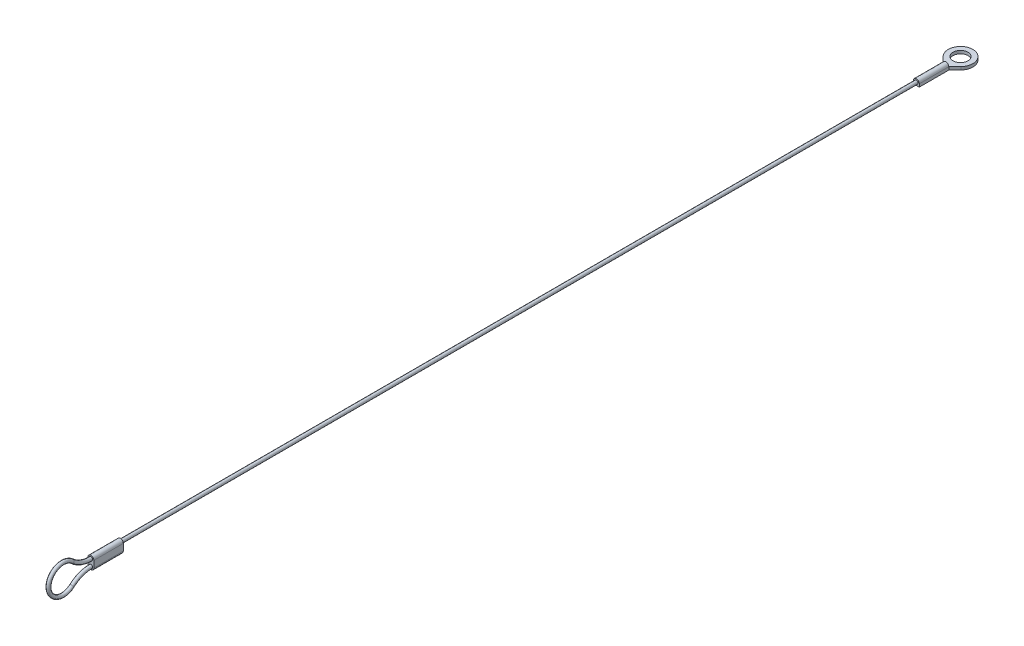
ISO-10303-21;
HEADER;
FILE_DESCRIPTION(('STEP AP214'),'2;1');
FILE_NAME('part.step','',(''),(''),'','','');
FILE_SCHEMA(('AUTOMOTIVE_DESIGN { 1 0 10303 214 1 1 1 1 }'));
ENDSEC;
DATA;
#1=APPLICATION_CONTEXT('core data for automotive mechanical design processes');
#2=APPLICATION_PROTOCOL_DEFINITION('international standard','automotive_design',2000,#1);
#3=PRODUCT_CONTEXT('',#1,'mechanical');
#4=PRODUCT('Part','Part','',(#3));
#5=PRODUCT_RELATED_PRODUCT_CATEGORY('part','',(#4));
#6=PRODUCT_DEFINITION_FORMATION('','',#4);
#7=PRODUCT_DEFINITION_CONTEXT('part definition',#1,'design');
#8=PRODUCT_DEFINITION('design','',#6,#7);
#9=PRODUCT_DEFINITION_SHAPE('','',#8);
#10=(LENGTH_UNIT() NAMED_UNIT(*) SI_UNIT(.MILLI.,.METRE.));
#11=(NAMED_UNIT(*) PLANE_ANGLE_UNIT() SI_UNIT($,.RADIAN.));
#12=(NAMED_UNIT(*) SI_UNIT($,.STERADIAN.) SOLID_ANGLE_UNIT());
#13=UNCERTAINTY_MEASURE_WITH_UNIT(LENGTH_MEASURE(1.E-05),#10,'distance_accuracy_value','');
#14=(GEOMETRIC_REPRESENTATION_CONTEXT(3) GLOBAL_UNCERTAINTY_ASSIGNED_CONTEXT((#13)) GLOBAL_UNIT_ASSIGNED_CONTEXT((#10,
#11,#12)) REPRESENTATION_CONTEXT('',''));
#15=CARTESIAN_POINT('',(0.,0.,0.));
#16=DIRECTION('',(0.,0.,1.));
#17=DIRECTION('',(1.,0.,0.));
#18=AXIS2_PLACEMENT_3D('',#15,#16,#17);
#19=CARTESIAN_POINT('',(0.,0.,-10.));
#20=DIRECTION('',(0.,0.,-1.));
#21=DIRECTION('',(-1.,0.,0.));
#22=AXIS2_PLACEMENT_3D('',#19,#20,#21);
#23=PLANE('',#22);
#24=CARTESIAN_POINT('',(0.,0.,-10.));
#25=DIRECTION('',(0.,0.,-1.));
#26=DIRECTION('',(-1.,0.,0.));
#27=AXIS2_PLACEMENT_3D('',#24,#25,#26);
#28=CIRCLE('',#27,0.995);
#29=CARTESIAN_POINT('',(-0.995,0.00749999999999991,-10.));
#30=VERTEX_POINT('',#29);
#31=CARTESIAN_POINT('',(0.995,0.00749999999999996,-10.));
#32=VERTEX_POINT('',#31);
#33=EDGE_CURVE('E178',#30,#32,#28,.T.);
#34=ORIENTED_EDGE('',*,*,#33,.T.);
#35=DIRECTION('',(-1.,0.,0.));
#36=VECTOR('',#35,1.);
#37=CARTESIAN_POINT('',(-0.995,0.015,-10.));
#38=LINE('',#37,#36);
#39=EDGE_CURVE('E135',#32,#30,#38,.T.);
#40=ORIENTED_EDGE('',*,*,#39,.T.);
#41=EDGE_LOOP('',(#34,#40));
#42=FACE_BOUND('',#41,.T.);
#43=ADVANCED_FACE('F39',(#42),#23,.T.);
#44=CARTESIAN_POINT('',(0.,0.,280.2));
#45=DIRECTION('',(0.,0.,-1.));
#46=DIRECTION('',(-1.,0.,0.));
#47=AXIS2_PLACEMENT_3D('',#44,#45,#46);
#48=CYLINDRICAL_SURFACE('',#47,0.595);
#49=CARTESIAN_POINT('',(0.,0.,270.2));
#50=DIRECTION('',(0.,0.,-1.));
#51=DIRECTION('',(0.,1.,0.));
#52=AXIS2_PLACEMENT_3D('',#49,#50,#51);
#53=CIRCLE('',#52,0.595);
#54=CARTESIAN_POINT('',(0.,0.595,270.2));
#55=VERTEX_POINT('',#54);
#56=EDGE_CURVE('E225',#55,#55,#53,.T.);
#57=ORIENTED_EDGE('',*,*,#56,.T.);
#58=EDGE_LOOP('',(#57));
#59=FACE_BOUND('',#58,.T.);
#60=CARTESIAN_POINT('',(0.,0.,0.));
#61=DIRECTION('',(0.,0.,1.));
#62=DIRECTION('',(1.,0.,0.));
#63=AXIS2_PLACEMENT_3D('',#60,#61,#62);
#64=CIRCLE('',#63,0.595);
#65=CARTESIAN_POINT('',(0.595,0.,0.));
#66=VERTEX_POINT('',#65);
#67=EDGE_CURVE('E201',#66,#66,#64,.T.);
#68=ORIENTED_EDGE('',*,*,#67,.T.);
#69=EDGE_LOOP('',(#68));
#70=FACE_BOUND('',#69,.T.);
#71=ADVANCED_FACE('F41',(#59,#70),#48,.T.);
#72=CARTESIAN_POINT('',(0.,3.90601902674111E-13,270.2));
#73=DIRECTION('',(0.,0.,1.));
#74=DIRECTION('',(0.,-1.,0.));
#75=AXIS2_PLACEMENT_3D('',#72,#73,#74);
#76=CYLINDRICAL_SURFACE('',#75,0.995);
#77=CARTESIAN_POINT('',(0.,4.05057931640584E-13,280.2));
#78=DIRECTION('',(0.,0.,-1.));
#79=DIRECTION('',(0.,1.,0.));
#80=AXIS2_PLACEMENT_3D('',#77,#78,#79);
#81=CIRCLE('',#80,0.995);
#82=CARTESIAN_POINT('',(-0.995,4.051797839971E-13,280.2));
#83=VERTEX_POINT('',#82);
#84=CARTESIAN_POINT('',(0.995,4.0493607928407E-13,280.2));
#85=VERTEX_POINT('',#84);
#86=EDGE_CURVE('E196',#83,#85,#81,.T.);
#87=ORIENTED_EDGE('',*,*,#86,.T.);
#88=DIRECTION('',(0.,0.,1.));
#89=VECTOR('',#88,1.);
#90=CARTESIAN_POINT('',(0.995,3.90480050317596E-13,270.2));
#91=LINE('',#90,#89);
#92=CARTESIAN_POINT('',(0.995,3.90480050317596E-13,270.2));
#93=VERTEX_POINT('',#92);
#94=EDGE_CURVE('E218',#93,#85,#91,.T.);
#95=ORIENTED_EDGE('',*,*,#94,.F.);
#96=CARTESIAN_POINT('',(0.,3.90601902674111E-13,270.2));
#97=DIRECTION('',(0.,0.,-1.));
#98=DIRECTION('',(0.,1.,0.));
#99=AXIS2_PLACEMENT_3D('',#96,#97,#98);
#100=CIRCLE('',#99,0.995);
#101=CARTESIAN_POINT('',(-0.995,3.90723755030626E-13,270.2));
#102=VERTEX_POINT('',#101);
#103=EDGE_CURVE('E185',#102,#93,#100,.T.);
#104=ORIENTED_EDGE('',*,*,#103,.F.);
#105=DIRECTION('',(0.,0.,1.));
#106=VECTOR('',#105,1.);
#107=CARTESIAN_POINT('',(-0.995,3.90723755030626E-13,270.2));
#108=LINE('',#107,#106);
#109=EDGE_CURVE('E195',#102,#83,#108,.T.);
#110=ORIENTED_EDGE('',*,*,#109,.T.);
#111=EDGE_LOOP('',(#87,#95,#104,#110));
#112=FACE_BOUND('',#111,.T.);
#113=ADVANCED_FACE('F419',(#112),#76,.T.);
#114=CARTESIAN_POINT('',(0.995,3.90480050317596E-13,270.2));
#115=DIRECTION('',(-1.,0.,0.));
#116=DIRECTION('',(0.,-1.,0.));
#117=AXIS2_PLACEMENT_3D('',#114,#115,#116);
#118=PLANE('',#117);
#119=DIRECTION('',(0.,-1.,0.));
#120=VECTOR('',#119,1.);
#121=CARTESIAN_POINT('',(0.995,4.0493607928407E-13,280.2));
#122=LINE('',#121,#120);
#123=CARTESIAN_POINT('',(0.994999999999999,-2.26625258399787,280.2));
#124=VERTEX_POINT('',#123);
#125=EDGE_CURVE('E200',#85,#124,#122,.T.);
#126=ORIENTED_EDGE('',*,*,#125,.T.);
#127=DIRECTION('',(0.,0.,1.));
#128=VECTOR('',#127,1.);
#129=CARTESIAN_POINT('',(0.994999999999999,-2.26625258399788,270.2));
#130=LINE('',#129,#128);
#131=CARTESIAN_POINT('',(0.994999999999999,-2.26625258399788,270.2));
#132=VERTEX_POINT('',#131);
#133=EDGE_CURVE('E214',#132,#124,#130,.T.);
#134=ORIENTED_EDGE('',*,*,#133,.F.);
#135=DIRECTION('',(0.,-1.,0.));
#136=VECTOR('',#135,1.);
#137=CARTESIAN_POINT('',(0.995,3.90480050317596E-13,270.2));
#138=LINE('',#137,#136);
#139=EDGE_CURVE('E87',#93,#132,#138,.T.);
#140=ORIENTED_EDGE('',*,*,#139,.F.);
#141=ORIENTED_EDGE('',*,*,#94,.T.);
#142=EDGE_LOOP('',(#126,#134,#140,#141));
#143=FACE_BOUND('',#142,.T.);
#144=ADVANCED_FACE('F412',(#143),#118,.F.);
#145=CARTESIAN_POINT('',(0.,-2.26625258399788,270.2));
#146=DIRECTION('',(0.,0.,1.));
#147=DIRECTION('',(0.,-1.,0.));
#148=AXIS2_PLACEMENT_3D('',#145,#146,#147);
#149=CYLINDRICAL_SURFACE('',#148,0.995);
#150=CARTESIAN_POINT('',(0.,-2.26625258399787,280.2));
#151=DIRECTION('',(0.,0.,-1.));
#152=DIRECTION('',(0.,1.,0.));
#153=AXIS2_PLACEMENT_3D('',#150,#151,#152);
#154=CIRCLE('',#153,0.995);
#155=CARTESIAN_POINT('',(-0.995,-2.26625258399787,280.2));
#156=VERTEX_POINT('',#155);
#157=EDGE_CURVE('E204',#124,#156,#154,.T.);
#158=ORIENTED_EDGE('',*,*,#157,.T.);
#159=DIRECTION('',(0.,0.,1.));
#160=VECTOR('',#159,1.);
#161=CARTESIAN_POINT('',(-0.995,-2.26625258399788,270.2));
#162=LINE('',#161,#160);
#163=CARTESIAN_POINT('',(-0.995,-2.26625258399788,270.2));
#164=VERTEX_POINT('',#163);
#165=EDGE_CURVE('E211',#164,#156,#162,.T.);
#166=ORIENTED_EDGE('',*,*,#165,.F.);
#167=CARTESIAN_POINT('',(0.,-2.26625258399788,270.2));
#168=DIRECTION('',(0.,0.,-1.));
#169=DIRECTION('',(0.,1.,0.));
#170=AXIS2_PLACEMENT_3D('',#167,#168,#169);
#171=CIRCLE('',#170,0.995);
#172=EDGE_CURVE('E190',#132,#164,#171,.T.);
#173=ORIENTED_EDGE('',*,*,#172,.F.);
#174=ORIENTED_EDGE('',*,*,#133,.T.);
#175=EDGE_LOOP('',(#158,#166,#173,#174));
#176=FACE_BOUND('',#175,.T.);
#177=ADVANCED_FACE('F406',(#176),#149,.T.);
#178=CARTESIAN_POINT('',(-0.995,3.90723755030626E-13,270.2));
#179=DIRECTION('',(1.,0.,0.));
#180=DIRECTION('',(0.,0.,-1.));
#181=AXIS2_PLACEMENT_3D('',#178,#179,#180);
#182=PLANE('',#181);
#183=DIRECTION('',(0.,1.,0.));
#184=VECTOR('',#183,1.);
#185=CARTESIAN_POINT('',(-0.995,4.051797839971E-13,280.2));
#186=LINE('',#185,#184);
#187=EDGE_CURVE('E79',#156,#83,#186,.T.);
#188=ORIENTED_EDGE('',*,*,#187,.T.);
#189=ORIENTED_EDGE('',*,*,#109,.F.);
#190=DIRECTION('',(0.,1.,0.));
#191=VECTOR('',#190,1.);
#192=CARTESIAN_POINT('',(-0.995,3.90723755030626E-13,270.2));
#193=LINE('',#192,#191);
#194=EDGE_CURVE('E59',#164,#102,#193,.T.);
#195=ORIENTED_EDGE('',*,*,#194,.F.);
#196=ORIENTED_EDGE('',*,*,#165,.T.);
#197=EDGE_LOOP('',(#188,#189,#195,#196));
#198=FACE_BOUND('',#197,.T.);
#199=ADVANCED_FACE('F400',(#198),#182,.F.);
#200=CARTESIAN_POINT('',(0.,3.90601902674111E-13,270.2));
#201=DIRECTION('',(0.,0.,-1.));
#202=DIRECTION('',(0.,1.,0.));
#203=AXIS2_PLACEMENT_3D('',#200,#201,#202);
#204=PLANE('',#203);
#205=ORIENTED_EDGE('',*,*,#56,.F.);
#206=EDGE_LOOP('',(#205));
#207=FACE_BOUND('',#206,.T.);
#208=ORIENTED_EDGE('',*,*,#103,.T.);
#209=ORIENTED_EDGE('',*,*,#139,.T.);
#210=ORIENTED_EDGE('',*,*,#172,.T.);
#211=ORIENTED_EDGE('',*,*,#194,.T.);
#212=EDGE_LOOP('',(#208,#209,#210,#211));
#213=FACE_BOUND('',#212,.T.);
#214=ADVANCED_FACE('F278',(#207,#213),#204,.T.);
#215=CARTESIAN_POINT('',(0.,4.05057931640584E-13,280.2));
#216=DIRECTION('',(0.,0.,-1.));
#217=DIRECTION('',(0.,1.,0.));
#218=AXIS2_PLACEMENT_3D('',#215,#216,#217);
#219=PLANE('',#218);
#220=CARTESIAN_POINT('',(0.,-2.26625258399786,280.2));
#221=DIRECTION('',(0.,0.,-1.));
#222=DIRECTION('',(1.,0.,0.));
#223=AXIS2_PLACEMENT_3D('',#220,#221,#222);
#224=CIRCLE('',#223,0.595);
#225=CARTESIAN_POINT('',(0.,-1.67125258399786,280.2));
#226=VERTEX_POINT('',#225);
#227=EDGE_CURVE('E226',#226,#226,#224,.T.);
#228=ORIENTED_EDGE('',*,*,#227,.T.);
#229=EDGE_LOOP('',(#228));
#230=FACE_BOUND('',#229,.T.);
#231=CARTESIAN_POINT('',(0.,0.,280.2));
#232=DIRECTION('',(0.,0.,-1.));
#233=DIRECTION('',(0.,1.,0.));
#234=AXIS2_PLACEMENT_3D('',#231,#232,#233);
#235=CIRCLE('',#234,0.595);
#236=CARTESIAN_POINT('',(0.,-0.595000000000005,280.2));
#237=VERTEX_POINT('',#236);
#238=EDGE_CURVE('E221',#237,#237,#235,.T.);
#239=ORIENTED_EDGE('',*,*,#238,.T.);
#240=EDGE_LOOP('',(#239));
#241=FACE_BOUND('',#240,.T.);
#242=ORIENTED_EDGE('',*,*,#86,.F.);
#243=ORIENTED_EDGE('',*,*,#187,.F.);
#244=ORIENTED_EDGE('',*,*,#157,.F.);
#245=ORIENTED_EDGE('',*,*,#125,.F.);
#246=EDGE_LOOP('',(#242,#243,#244,#245));
#247=FACE_BOUND('',#246,.T.);
#248=ADVANCED_FACE('F388',(#230,#241,#247),#219,.F.);
#249=CARTESIAN_POINT('',(0.,-11.8662525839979,280.2));
#250=DIRECTION('',(1.,0.,0.));
#251=DIRECTION('',(0.,0.,-1.));
#252=AXIS2_PLACEMENT_3D('',#249,#250,#251);
#253=TOROIDAL_SURFACE('',#252,9.6,0.595);
#254=CARTESIAN_POINT('',(0.,-4.7108350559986,286.6));
#255=DIRECTION('',(0.,0.666666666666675,-0.745355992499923));
#256=DIRECTION('',(1.,0.,0.));
#257=AXIS2_PLACEMENT_3D('',#254,#255,#256);
#258=CIRCLE('',#257,0.595);
#259=CARTESIAN_POINT('',(0.,-4.26734824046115,286.996666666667));
#260=VERTEX_POINT('',#259);
#261=EDGE_CURVE('E50',#260,#260,#258,.T.);
#262=CARTESIAN_POINT('',(0.,-11.8662525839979,280.2));
#263=DIRECTION('',(1.,0.,0.));
#264=DIRECTION('',(0.,0.,-1.));
#265=AXIS2_PLACEMENT_3D('',#262,#263,#264);
#266=CIRCLE('',#265,10.195);
#267=EDGE_CURVE('',#226,#260,#266,.T.);
#268=ORIENTED_EDGE('',*,*,#227,.F.);
#269=ORIENTED_EDGE('',*,*,#261,.T.);
#270=ORIENTED_EDGE('',*,*,#267,.T.);
#271=ORIENTED_EDGE('',*,*,#267,.F.);
#272=EDGE_LOOP('',(#268,#270,#269,#271));
#273=FACE_BOUND('',#272,.T.);
#274=ADVANCED_FACE('F381',(#273),#253,.T.);
#275=CARTESIAN_POINT('',(0.,-1.13312629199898,289.8));
#276=DIRECTION('',(-1.,0.,0.));
#277=DIRECTION('',(0.,0.,1.));
#278=AXIS2_PLACEMENT_3D('',#275,#276,#277);
#279=TOROIDAL_SURFACE('',#278,4.79999999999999,0.595);
#280=CARTESIAN_POINT('',(0.,2.44458247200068,286.6));
#281=DIRECTION('',(0.,0.666666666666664,0.745355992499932));
#282=DIRECTION('',(1.,0.,0.));
#283=AXIS2_PLACEMENT_3D('',#280,#281,#282);
#284=CIRCLE('',#283,0.595);
#285=CARTESIAN_POINT('',(0.,2.00109565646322,286.996666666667));
#286=VERTEX_POINT('',#285);
#287=EDGE_CURVE('E11',#286,#286,#284,.T.);
#288=ORIENTED_EDGE('',*,*,#287,.T.);
#289=EDGE_LOOP('',(#288));
#290=FACE_BOUND('',#289,.T.);
#291=ORIENTED_EDGE('',*,*,#261,.F.);
#292=EDGE_LOOP('',(#291));
#293=FACE_BOUND('',#292,.T.);
#294=ADVANCED_FACE('F375',(#290,#293),#279,.T.);
#295=CARTESIAN_POINT('',(0.,9.6,280.2));
#296=DIRECTION('',(1.,0.,0.));
#297=DIRECTION('',(0.,0.,-1.));
#298=AXIS2_PLACEMENT_3D('',#295,#296,#297);
#299=TOROIDAL_SURFACE('',#298,9.6,0.595);
#300=CARTESIAN_POINT('',(0.,9.6,280.2));
#301=DIRECTION('',(1.,0.,0.));
#302=DIRECTION('',(0.,0.,-1.));
#303=AXIS2_PLACEMENT_3D('',#300,#301,#302);
#304=CIRCLE('',#303,10.195);
#305=EDGE_CURVE('',#286,#237,#304,.T.);
#306=ORIENTED_EDGE('',*,*,#287,.F.);
#307=ORIENTED_EDGE('',*,*,#238,.F.);
#308=ORIENTED_EDGE('',*,*,#305,.T.);
#309=ORIENTED_EDGE('',*,*,#305,.F.);
#310=EDGE_LOOP('',(#306,#308,#307,#309));
#311=FACE_BOUND('',#310,.T.);
#312=ADVANCED_FACE('F276',(#311),#299,.T.);
#313=CARTESIAN_POINT('',(0.,0.,-10.));
#314=DIRECTION('',(0.,0.,1.));
#315=DIRECTION('',(1.,0.,0.));
#316=AXIS2_PLACEMENT_3D('',#313,#314,#315);
#317=CYLINDRICAL_SURFACE('',#316,0.995);
#318=CARTESIAN_POINT('',(0.,0.,0.));
#319=DIRECTION('',(0.,0.,-1.));
#320=DIRECTION('',(-1.,0.,0.));
#321=AXIS2_PLACEMENT_3D('',#318,#319,#320);
#322=CIRCLE('',#321,0.995);
#323=CARTESIAN_POINT('',(-0.995,0.,0.));
#324=VERTEX_POINT('',#323);
#325=CARTESIAN_POINT('',(0.995,0.,0.));
#326=VERTEX_POINT('',#325);
#327=EDGE_CURVE('E164',#324,#326,#322,.T.);
#328=ORIENTED_EDGE('',*,*,#327,.T.);
#329=DIRECTION('',(0.,0.,1.));
#330=VECTOR('',#329,1.);
#331=CARTESIAN_POINT('',(0.995,0.,-10.));
#332=LINE('',#331,#330);
#333=EDGE_CURVE('E235',#32,#326,#332,.T.);
#334=ORIENTED_EDGE('',*,*,#333,.F.);
#335=ORIENTED_EDGE('',*,*,#33,.F.);
#336=DIRECTION('',(0.,0.,1.));
#337=VECTOR('',#336,1.);
#338=CARTESIAN_POINT('',(-0.995,0.,-10.));
#339=LINE('',#338,#337);
#340=EDGE_CURVE('E184',#30,#324,#339,.T.);
#341=ORIENTED_EDGE('',*,*,#340,.T.);
#342=EDGE_LOOP('',(#328,#334,#335,#341));
#343=FACE_BOUND('',#342,.T.);
#344=ADVANCED_FACE('F271',(#343),#317,.T.);
#345=CARTESIAN_POINT('',(0.995,0.,-10.));
#346=DIRECTION('',(-1.,0.,0.));
#347=DIRECTION('',(0.,-1.,0.));
#348=AXIS2_PLACEMENT_3D('',#345,#346,#347);
#349=PLANE('',#348);
#350=DIRECTION('',(0.,-1.,0.));
#351=VECTOR('',#350,1.);
#352=CARTESIAN_POINT('',(0.995,0.,0.));
#353=LINE('',#352,#351);
#354=CARTESIAN_POINT('',(0.995,-0.995,0.));
#355=VERTEX_POINT('',#354);
#356=EDGE_CURVE('E168',#326,#355,#353,.T.);
#357=ORIENTED_EDGE('',*,*,#356,.T.);
#358=DIRECTION('',(0.,0.,1.));
#359=VECTOR('',#358,1.);
#360=CARTESIAN_POINT('',(0.995,-0.995,-10.));
#361=LINE('',#360,#359);
#362=CARTESIAN_POINT('',(0.995,-0.995,-10.));
#363=VERTEX_POINT('',#362);
#364=EDGE_CURVE('E183',#363,#355,#361,.T.);
#365=ORIENTED_EDGE('',*,*,#364,.F.);
#366=DIRECTION('',(0.,-1.,0.));
#367=VECTOR('',#366,1.);
#368=CARTESIAN_POINT('',(0.995,0.,-10.));
#369=LINE('',#368,#367);
#370=EDGE_CURVE('E247',#32,#363,#369,.T.);
#371=ORIENTED_EDGE('',*,*,#370,.F.);
#372=ORIENTED_EDGE('',*,*,#333,.T.);
#373=EDGE_LOOP('',(#357,#365,#371,#372));
#374=FACE_BOUND('',#373,.T.);
#375=ADVANCED_FACE('F260',(#374),#349,.F.);
#376=CARTESIAN_POINT('',(0.,-0.995,-10.));
#377=DIRECTION('',(0.,1.,0.));
#378=DIRECTION('',(0.,0.,1.));
#379=AXIS2_PLACEMENT_3D('',#376,#377,#378);
#380=PLANE('',#379);
#381=DIRECTION('',(-1.,0.,0.));
#382=VECTOR('',#381,1.);
#383=CARTESIAN_POINT('',(0.,-0.995,0.));
#384=LINE('',#383,#382);
#385=CARTESIAN_POINT('',(-0.995,-0.995,0.));
#386=VERTEX_POINT('',#385);
#387=EDGE_CURVE('E172',#355,#386,#384,.T.);
#388=ORIENTED_EDGE('',*,*,#387,.T.);
#389=DIRECTION('',(0.,0.,1.));
#390=VECTOR('',#389,1.);
#391=CARTESIAN_POINT('',(-0.995,-0.995,-10.));
#392=LINE('',#391,#390);
#393=CARTESIAN_POINT('',(-0.995,-0.995,-10.));
#394=VERTEX_POINT('',#393);
#395=EDGE_CURVE('E179',#394,#386,#392,.T.);
#396=ORIENTED_EDGE('',*,*,#395,.F.);
#397=DIRECTION('',(-0.69489731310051,0.,-0.719108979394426));
#398=VECTOR('',#397,1.);
#399=CARTESIAN_POINT('',(-3.01306662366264,-0.995,-12.0883802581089));
#400=LINE('',#399,#398);
#401=CARTESIAN_POINT('',(-3.01306662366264,-0.995,-12.0883802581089));
#402=VERTEX_POINT('',#401);
#403=EDGE_CURVE('E514',#394,#402,#400,.T.);
#404=ORIENTED_EDGE('',*,*,#403,.T.);
#405=CARTESIAN_POINT('',(0.,-0.995,-15.));
#406=DIRECTION('',(0.,-1.,0.));
#407=DIRECTION('',(0.,0.,1.));
#408=AXIS2_PLACEMENT_3D('',#405,#406,#407);
#409=CIRCLE('',#408,4.19);
#410=CARTESIAN_POINT('',(3.01306662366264,-0.995,-12.0883802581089));
#411=VERTEX_POINT('',#410);
#412=EDGE_CURVE('E129',#402,#411,#409,.T.);
#413=ORIENTED_EDGE('',*,*,#412,.T.);
#414=DIRECTION('',(-0.69489731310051,0.,0.719108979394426));
#415=VECTOR('',#414,1.);
#416=CARTESIAN_POINT('',(0.995,-0.995,-10.));
#417=LINE('',#416,#415);
#418=EDGE_CURVE('E152',#411,#363,#417,.T.);
#419=ORIENTED_EDGE('',*,*,#418,.T.);
#420=ORIENTED_EDGE('',*,*,#364,.T.);
#421=EDGE_LOOP('',(#388,#396,#404,#413,#419,#420));
#422=FACE_BOUND('',#421,.T.);
#423=CARTESIAN_POINT('',(0.,-0.995,-15.));
#424=DIRECTION('',(0.,-1.,0.));
#425=DIRECTION('',(0.,0.,-1.));
#426=AXIS2_PLACEMENT_3D('',#423,#424,#425);
#427=CIRCLE('',#426,2.54);
#428=CARTESIAN_POINT('',(0.,-0.995,-17.54));
#429=VERTEX_POINT('',#428);
#430=EDGE_CURVE('E510',#429,#429,#427,.T.);
#431=ORIENTED_EDGE('',*,*,#430,.F.);
#432=EDGE_LOOP('',(#431));
#433=FACE_BOUND('',#432,.T.);
#434=ADVANCED_FACE('F270',(#422,#433),#380,.F.);
#435=CARTESIAN_POINT('',(-0.995,-0.995,-10.));
#436=DIRECTION('',(1.,0.,0.));
#437=DIRECTION('',(0.,1.,0.));
#438=AXIS2_PLACEMENT_3D('',#435,#436,#437);
#439=PLANE('',#438);
#440=DIRECTION('',(0.,1.,0.));
#441=VECTOR('',#440,1.);
#442=CARTESIAN_POINT('',(-0.995,-0.995,0.));
#443=LINE('',#442,#441);
#444=EDGE_CURVE('E175',#386,#324,#443,.T.);
#445=ORIENTED_EDGE('',*,*,#444,.T.);
#446=ORIENTED_EDGE('',*,*,#340,.F.);
#447=DIRECTION('',(0.,1.,0.));
#448=VECTOR('',#447,1.);
#449=CARTESIAN_POINT('',(-0.995,-0.995,-10.));
#450=LINE('',#449,#448);
#451=EDGE_CURVE('E149',#394,#30,#450,.T.);
#452=ORIENTED_EDGE('',*,*,#451,.F.);
#453=ORIENTED_EDGE('',*,*,#395,.T.);
#454=EDGE_LOOP('',(#445,#446,#452,#453));
#455=FACE_BOUND('',#454,.T.);
#456=ADVANCED_FACE('F314',(#455),#439,.F.);
#457=CARTESIAN_POINT('',(0.,0.,0.));
#458=DIRECTION('',(0.,0.,-1.));
#459=DIRECTION('',(-1.,0.,0.));
#460=AXIS2_PLACEMENT_3D('',#457,#458,#459);
#461=PLANE('',#460);
#462=ORIENTED_EDGE('',*,*,#67,.F.);
#463=EDGE_LOOP('',(#462));
#464=FACE_BOUND('',#463,.T.);
#465=ORIENTED_EDGE('',*,*,#327,.F.);
#466=ORIENTED_EDGE('',*,*,#444,.F.);
#467=ORIENTED_EDGE('',*,*,#387,.F.);
#468=ORIENTED_EDGE('',*,*,#356,.F.);
#469=EDGE_LOOP('',(#465,#466,#467,#468));
#470=FACE_BOUND('',#469,.T.);
#471=ADVANCED_FACE('F310',(#464,#470),#461,.F.);
#472=CARTESIAN_POINT('',(-3.01306662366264,0.015,-12.0883802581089));
#473=DIRECTION('',(-0.719108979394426,0.,0.69489731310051));
#474=DIRECTION('',(0.69489731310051,0.,0.719108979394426));
#475=AXIS2_PLACEMENT_3D('',#472,#473,#474);
#476=PLANE('',#475);
#477=ORIENTED_EDGE('',*,*,#403,.F.);
#478=ORIENTED_EDGE('',*,*,#451,.T.);
#479=DIRECTION('',(-0.69489731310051,0.,-0.719108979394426));
#480=VECTOR('',#479,1.);
#481=CARTESIAN_POINT('',(-3.01306662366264,0.015,-12.0883802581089));
#482=LINE('',#481,#480);
#483=CARTESIAN_POINT('',(-3.01306662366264,0.015,-12.0883802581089));
#484=VERTEX_POINT('',#483);
#485=EDGE_CURVE('E142',#30,#484,#482,.T.);
#486=ORIENTED_EDGE('',*,*,#485,.T.);
#487=DIRECTION('',(0.,-1.,0.));
#488=VECTOR('',#487,1.);
#489=CARTESIAN_POINT('',(-3.01306662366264,0.015,-12.0883802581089));
#490=LINE('',#489,#488);
#491=EDGE_CURVE('E124',#484,#402,#490,.T.);
#492=ORIENTED_EDGE('',*,*,#491,.T.);
#493=EDGE_LOOP('',(#477,#478,#486,#492));
#494=FACE_BOUND('',#493,.T.);
#495=ADVANCED_FACE('F147',(#494),#476,.T.);
#496=CARTESIAN_POINT('',(0.995,0.015,-10.));
#497=DIRECTION('',(0.719108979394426,0.,0.69489731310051));
#498=DIRECTION('',(0.69489731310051,0.,-0.719108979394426));
#499=AXIS2_PLACEMENT_3D('',#496,#497,#498);
#500=PLANE('',#499);
#501=ORIENTED_EDGE('',*,*,#418,.F.);
#502=DIRECTION('',(0.,-1.,0.));
#503=VECTOR('',#502,1.);
#504=CARTESIAN_POINT('',(3.01306662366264,0.015,-12.0883802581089));
#505=LINE('',#504,#503);
#506=CARTESIAN_POINT('',(3.01306662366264,0.015,-12.0883802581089));
#507=VERTEX_POINT('',#506);
#508=EDGE_CURVE('E134',#507,#411,#505,.T.);
#509=ORIENTED_EDGE('',*,*,#508,.F.);
#510=DIRECTION('',(-0.69489731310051,0.,0.719108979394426));
#511=VECTOR('',#510,1.);
#512=CARTESIAN_POINT('',(0.995,0.015,-10.));
#513=LINE('',#512,#511);
#514=EDGE_CURVE('E144',#507,#32,#513,.T.);
#515=ORIENTED_EDGE('',*,*,#514,.T.);
#516=ORIENTED_EDGE('',*,*,#370,.T.);
#517=EDGE_LOOP('',(#501,#509,#515,#516));
#518=FACE_BOUND('',#517,.T.);
#519=ADVANCED_FACE('F330',(#518),#500,.T.);
#520=CARTESIAN_POINT('',(0.,0.015,-15.));
#521=DIRECTION('',(0.,-1.,0.));
#522=DIRECTION('',(0.,0.,-1.));
#523=AXIS2_PLACEMENT_3D('',#520,#521,#522);
#524=CYLINDRICAL_SURFACE('',#523,4.19);
#525=ORIENTED_EDGE('',*,*,#412,.F.);
#526=ORIENTED_EDGE('',*,*,#491,.F.);
#527=CARTESIAN_POINT('',(0.,0.015,-15.));
#528=DIRECTION('',(0.,-1.,0.));
#529=DIRECTION('',(0.,0.,1.));
#530=AXIS2_PLACEMENT_3D('',#527,#528,#529);
#531=CIRCLE('',#530,4.19);
#532=EDGE_CURVE('E127',#484,#507,#531,.T.);
#533=ORIENTED_EDGE('',*,*,#532,.T.);
#534=ORIENTED_EDGE('',*,*,#508,.T.);
#535=EDGE_LOOP('',(#525,#526,#533,#534));
#536=FACE_BOUND('',#535,.T.);
#537=ADVANCED_FACE('F126',(#536),#524,.T.);
#538=CARTESIAN_POINT('',(0.,0.015,-15.));
#539=DIRECTION('',(0.,1.,0.));
#540=DIRECTION('',(0.,0.,1.));
#541=AXIS2_PLACEMENT_3D('',#538,#539,#540);
#542=PLANE('',#541);
#543=CARTESIAN_POINT('',(0.,0.015,-15.));
#544=DIRECTION('',(0.,-1.,0.));
#545=DIRECTION('',(0.,0.,-1.));
#546=AXIS2_PLACEMENT_3D('',#543,#544,#545);
#547=CIRCLE('',#546,2.54);
#548=CARTESIAN_POINT('',(0.,0.015,-17.54));
#549=VERTEX_POINT('',#548);
#550=EDGE_CURVE('E507',#549,#549,#547,.T.);
#551=ORIENTED_EDGE('',*,*,#550,.T.);
#552=EDGE_LOOP('',(#551));
#553=FACE_BOUND('',#552,.T.);
#554=ORIENTED_EDGE('',*,*,#485,.F.);
#555=ORIENTED_EDGE('',*,*,#39,.F.);
#556=ORIENTED_EDGE('',*,*,#514,.F.);
#557=ORIENTED_EDGE('',*,*,#532,.F.);
#558=EDGE_LOOP('',(#554,#555,#556,#557));
#559=FACE_BOUND('',#558,.T.);
#560=ADVANCED_FACE('F140',(#553,#559),#542,.T.);
#561=CARTESIAN_POINT('',(0.,0.015,-15.));
#562=DIRECTION('',(0.,-1.,0.));
#563=DIRECTION('',(0.,0.,-1.));
#564=AXIS2_PLACEMENT_3D('',#561,#562,#563);
#565=CYLINDRICAL_SURFACE('',#564,2.54);
#566=ORIENTED_EDGE('',*,*,#550,.F.);
#567=EDGE_LOOP('',(#566));
#568=FACE_BOUND('',#567,.T.);
#569=ORIENTED_EDGE('',*,*,#430,.T.);
#570=EDGE_LOOP('',(#569));
#571=FACE_BOUND('',#570,.T.);
#572=ADVANCED_FACE('F487',(#568,#571),#565,.F.);
#573=CLOSED_SHELL('',(#43,#71,#113,#144,#177,#199,#214,#248,#274,#294,#312,#344,#375,#434,#456,
#471,#495,#519,#537,#560,#572));
#574=MANIFOLD_SOLID_BREP('B2',#573);
#575=ADVANCED_BREP_SHAPE_REPRESENTATION('',(#18,#574),#14);
#576=SHAPE_DEFINITION_REPRESENTATION(#9,#575);
ENDSEC;
END-ISO-10303-21;
